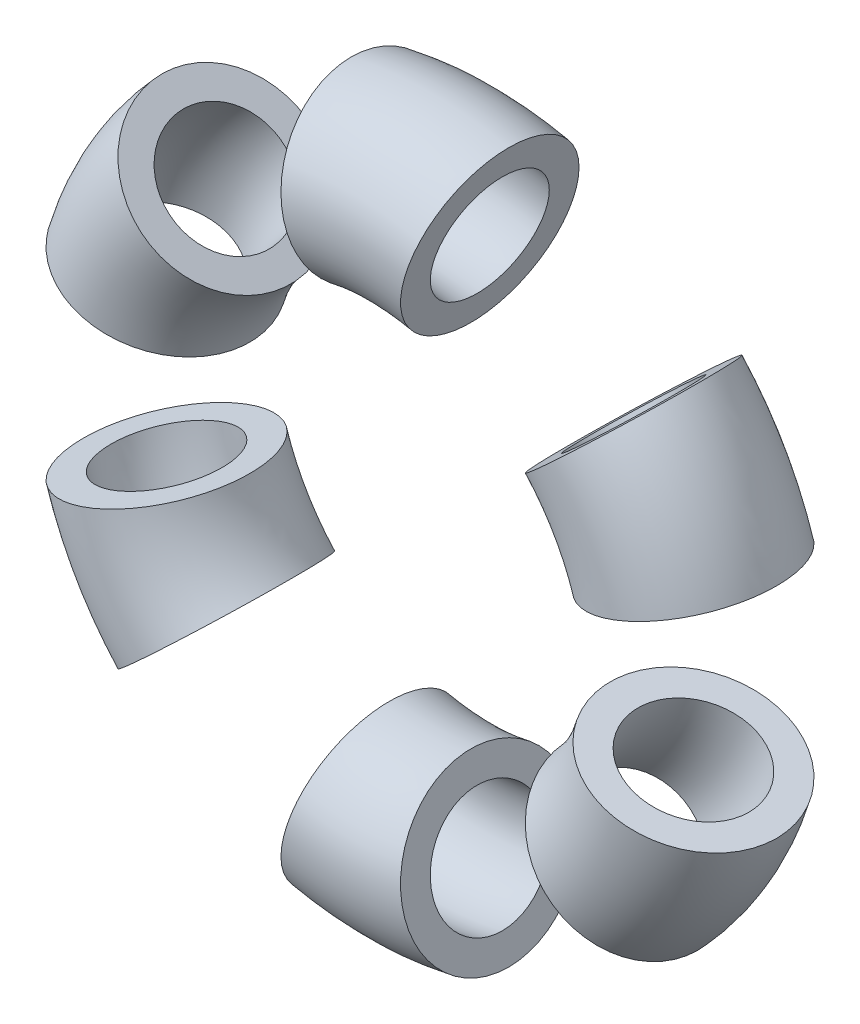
from build123d import *
from build123d.topology import SkipClean

# Parameters (mm, degrees)
SKIZZE2_R          = 3
SKIZZE2_R_2        = 2
ROTATION1_ANGLE    = 25
KREISMUSTER1_COUNT = 6


with BuildPart() as part:
    # Skizze2 → Rotation1 (revolve, symmetric)
    with SkipClean():  # the faces are left unmerged after this step: merging them gives an invalid solid
        with BuildSketch(Plane(origin=(0, 0, 0), x_dir=(0, 0, -1), z_dir=(1, 0, 0))) as rotation1_sk:
            with Locations((0, 9.5)):
                Circle(SKIZZE2_R)
            with Locations((0, 9.5)):
                Circle(SKIZZE2_R_2, mode=Mode.SUBTRACT)
        revolve(axis=Axis((0, 0, 37.728194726), (0, 0, -1)), revolution_arc=ROTATION1_ANGLE / 2)
        revolve(rotation1_sk.sketch, axis=Axis((0, 0, 37.728194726), (0, 0, 1)), revolution_arc=ROTATION1_ANGLE / 2)


with BuildPart() as kreismuster1_1:
    # Kreismuster1: pattern copy
    add(part.part.rotate(Axis((0, 0, 0), (0, 0, 1)), 1 * 360 / KREISMUSTER1_COUNT))


with BuildPart() as kreismuster1_2:
    # Kreismuster1: pattern copy
    add(part.part.rotate(Axis((0, 0, 0), (0, 0, 1)), 2 * 360 / KREISMUSTER1_COUNT))


with BuildPart() as kreismuster1_3:
    # Kreismuster1: pattern copy
    add(part.part.rotate(Axis((0, 0, 0), (0, 0, 1)), 3 * 360 / KREISMUSTER1_COUNT))


with BuildPart() as kreismuster1_4:
    # Kreismuster1: pattern copy
    add(part.part.rotate(Axis((0, 0, 0), (0, 0, 1)), 4 * 360 / KREISMUSTER1_COUNT))


with BuildPart() as kreismuster1_5:
    # Kreismuster1: pattern copy
    add(part.part.rotate(Axis((0, 0, 0), (0, 0, 1)), 5 * 360 / KREISMUSTER1_COUNT))


solid = Compound([part.part, kreismuster1_1.part, kreismuster1_2.part, kreismuster1_3.part, kreismuster1_4.part, kreismuster1_5.part])
